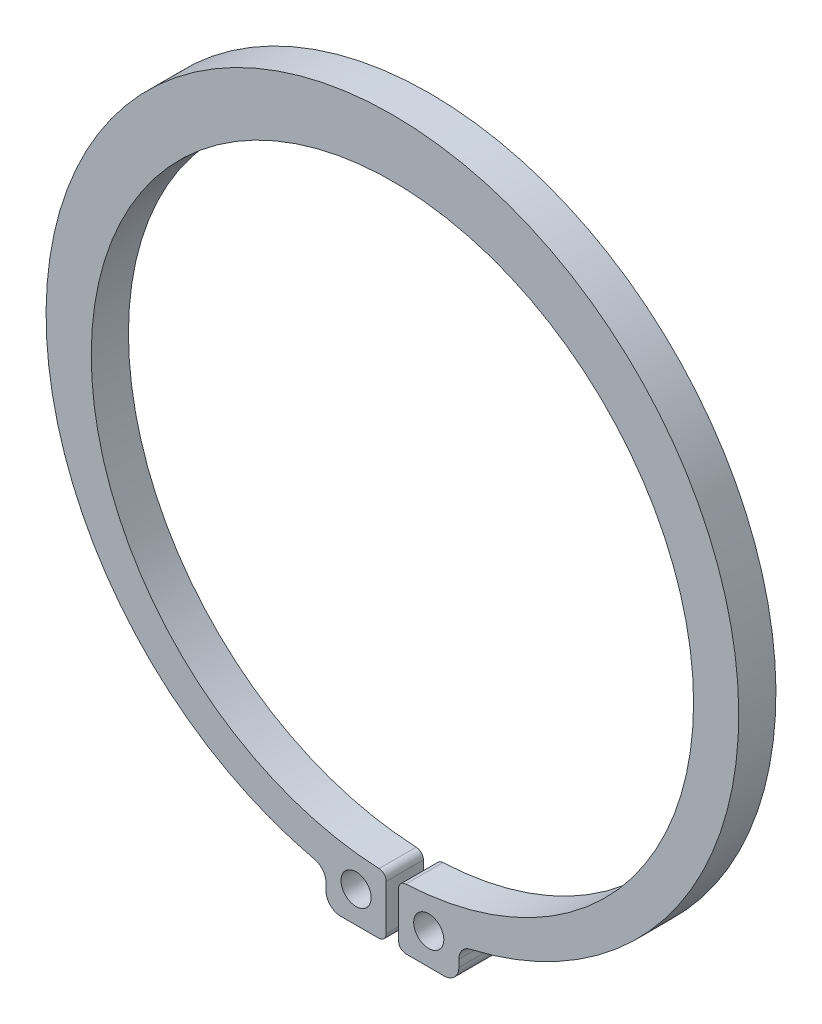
ISO-10303-21;
HEADER;
FILE_DESCRIPTION(('STEP AP214'),'2;1');
FILE_NAME('part.step','',(''),(''),'','','');
FILE_SCHEMA(('AUTOMOTIVE_DESIGN { 1 0 10303 214 1 1 1 1 }'));
ENDSEC;
DATA;
#1=APPLICATION_CONTEXT('core data for automotive mechanical design processes');
#2=APPLICATION_PROTOCOL_DEFINITION('international standard','automotive_design',2000,#1);
#3=PRODUCT_CONTEXT('',#1,'mechanical');
#4=PRODUCT('Part','Part','',(#3));
#5=PRODUCT_RELATED_PRODUCT_CATEGORY('part','',(#4));
#6=PRODUCT_DEFINITION_FORMATION('','',#4);
#7=PRODUCT_DEFINITION_CONTEXT('part definition',#1,'design');
#8=PRODUCT_DEFINITION('design','',#6,#7);
#9=PRODUCT_DEFINITION_SHAPE('','',#8);
#10=(LENGTH_UNIT() NAMED_UNIT(*) SI_UNIT(.MILLI.,.METRE.));
#11=(NAMED_UNIT(*) PLANE_ANGLE_UNIT() SI_UNIT($,.RADIAN.));
#12=(NAMED_UNIT(*) SI_UNIT($,.STERADIAN.) SOLID_ANGLE_UNIT());
#13=UNCERTAINTY_MEASURE_WITH_UNIT(LENGTH_MEASURE(1.E-05),#10,'distance_accuracy_value','');
#14=(GEOMETRIC_REPRESENTATION_CONTEXT(3) GLOBAL_UNCERTAINTY_ASSIGNED_CONTEXT((#13)) GLOBAL_UNIT_ASSIGNED_CONTEXT((#10,
#11,#12)) REPRESENTATION_CONTEXT('',''));
#15=CARTESIAN_POINT('',(0.,0.,0.));
#16=DIRECTION('',(0.,0.,1.));
#17=DIRECTION('',(1.,0.,0.));
#18=AXIS2_PLACEMENT_3D('',#15,#16,#17);
#19=CARTESIAN_POINT('',(0.,0.,1.));
#20=DIRECTION('',(0.,0.,1.));
#21=DIRECTION('',(1.,0.,0.));
#22=AXIS2_PLACEMENT_3D('',#19,#20,#21);
#23=PLANE('',#22);
#24=DIRECTION('',(-1.,0.,0.));
#25=VECTOR('',#24,1.);
#26=CARTESIAN_POINT('',(-0.166666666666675,-10.0516184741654,1.));
#27=LINE('',#26,#25);
#28=CARTESIAN_POINT('',(-0.369166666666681,-10.0516184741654,1.));
#29=VERTEX_POINT('',#28);
#30=CARTESIAN_POINT('',(-1.39154471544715,-10.0516184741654,1.));
#31=VERTEX_POINT('',#30);
#32=EDGE_CURVE('E158',#29,#31,#27,.T.);
#33=ORIENTED_EDGE('',*,*,#32,.F.);
#34=CARTESIAN_POINT('',(-0.369166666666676,-9.8491184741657,1.));
#35=DIRECTION('',(0.,0.,1.));
#36=DIRECTION('',(1.,0.,0.));
#37=AXIS2_PLACEMENT_3D('',#34,#35,#36);
#38=CIRCLE('',#37,0.2025);
#39=CARTESIAN_POINT('',(-0.166666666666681,-9.84911847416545,1.));
#40=VERTEX_POINT('',#39);
#41=EDGE_CURVE('E224',#29,#40,#38,.T.);
#42=ORIENTED_EDGE('',*,*,#41,.T.);
#43=DIRECTION('',(0.,-1.,0.));
#44=VECTOR('',#43,1.);
#45=CARTESIAN_POINT('',(-0.166666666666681,-8.43161847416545,1.));
#46=LINE('',#45,#44);
#47=CARTESIAN_POINT('',(-0.166666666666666,-8.62762186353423,1.));
#48=VERTEX_POINT('',#47);
#49=EDGE_CURVE('E172',#48,#40,#46,.T.);
#50=ORIENTED_EDGE('',*,*,#49,.F.);
#51=CARTESIAN_POINT('',(-0.369166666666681,-8.62762186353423,1.));
#52=DIRECTION('',(0.,0.,1.));
#53=DIRECTION('',(1.,0.,0.));
#54=AXIS2_PLACEMENT_3D('',#51,#52,#53);
#55=CIRCLE('',#54,0.2025);
#56=CARTESIAN_POINT('',(-0.36016260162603,-8.42532214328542,1.));
#57=VERTEX_POINT('',#56);
#58=EDGE_CURVE('E220',#48,#57,#55,.T.);
#59=ORIENTED_EDGE('',*,*,#58,.T.);
#60=CARTESIAN_POINT('',(0.,-0.333333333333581,1.));
#61=DIRECTION('',(0.,0.,1.));
#62=DIRECTION('',(1.,0.,0.));
#63=AXIS2_PLACEMENT_3D('',#60,#61,#62);
#64=CIRCLE('',#63,8.1);
#65=CARTESIAN_POINT('',(0.360162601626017,-8.42532214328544,1.));
#66=VERTEX_POINT('',#65);
#67=EDGE_CURVE('E175',#66,#57,#64,.T.);
#68=ORIENTED_EDGE('',*,*,#67,.F.);
#69=CARTESIAN_POINT('',(0.369166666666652,-8.62762186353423,1.));
#70=DIRECTION('',(0.,0.,1.));
#71=DIRECTION('',(1.,0.,0.));
#72=AXIS2_PLACEMENT_3D('',#69,#70,#71);
#73=CIRCLE('',#72,0.2025);
#74=CARTESIAN_POINT('',(0.166666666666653,-8.62762186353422,1.));
#75=VERTEX_POINT('',#74);
#76=EDGE_CURVE('E218',#66,#75,#73,.T.);
#77=ORIENTED_EDGE('',*,*,#76,.T.);
#78=DIRECTION('',(0.,-1.,0.));
#79=VECTOR('',#78,1.);
#80=CARTESIAN_POINT('',(0.166666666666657,-8.4316184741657,1.));
#81=LINE('',#80,#79);
#82=CARTESIAN_POINT('',(0.166666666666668,-9.84911847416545,1.));
#83=VERTEX_POINT('',#82);
#84=EDGE_CURVE('E176',#75,#83,#81,.T.);
#85=ORIENTED_EDGE('',*,*,#84,.T.);
#86=CARTESIAN_POINT('',(0.369166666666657,-9.8491184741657,1.));
#87=DIRECTION('',(0.,0.,1.));
#88=DIRECTION('',(1.,0.,0.));
#89=AXIS2_PLACEMENT_3D('',#86,#87,#88);
#90=CIRCLE('',#89,0.2025);
#91=CARTESIAN_POINT('',(0.369166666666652,-10.0516184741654,1.));
#92=VERTEX_POINT('',#91);
#93=EDGE_CURVE('E222',#83,#92,#90,.T.);
#94=ORIENTED_EDGE('',*,*,#93,.T.);
#95=DIRECTION('',(1.,0.,0.));
#96=VECTOR('',#95,1.);
#97=CARTESIAN_POINT('',(0.166666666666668,-10.0516184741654,1.));
#98=LINE('',#97,#96);
#99=CARTESIAN_POINT('',(1.39154471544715,-10.0516184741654,1.));
#100=VERTEX_POINT('',#99);
#101=EDGE_CURVE('E269',#92,#100,#98,.T.);
#102=ORIENTED_EDGE('',*,*,#101,.T.);
#103=CARTESIAN_POINT('',(1.39154471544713,-9.65649652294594,1.));
#104=DIRECTION('',(0.,0.,1.));
#105=DIRECTION('',(1.,0.,0.));
#106=AXIS2_PLACEMENT_3D('',#103,#104,#105);
#107=CIRCLE('',#106,0.395121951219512);
#108=CARTESIAN_POINT('',(1.78666666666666,-9.65649652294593,1.));
#109=VERTEX_POINT('',#108);
#110=EDGE_CURVE('E140',#100,#109,#107,.T.);
#111=ORIENTED_EDGE('',*,*,#110,.T.);
#112=DIRECTION('',(0.,1.,0.));
#113=VECTOR('',#112,1.);
#114=CARTESIAN_POINT('',(1.78666666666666,-10.0516184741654,1.));
#115=LINE('',#114,#113);
#116=CARTESIAN_POINT('',(1.78666666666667,-9.46183210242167,1.));
#117=VERTEX_POINT('',#116);
#118=EDGE_CURVE('E271',#109,#117,#115,.T.);
#119=ORIENTED_EDGE('',*,*,#118,.T.);
#120=CARTESIAN_POINT('',(2.18178861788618,-9.46183210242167,1.));
#121=DIRECTION('',(0.,0.,1.));
#122=DIRECTION('',(1.,0.,0.));
#123=AXIS2_PLACEMENT_3D('',#120,#121,#122);
#124=CIRCLE('',#123,0.395121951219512);
#125=CARTESIAN_POINT('',(2.09300779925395,-9.07681350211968,1.));
#126=VERTEX_POINT('',#125);
#127=EDGE_CURVE('E213',#117,#126,#124,.F.);
#128=ORIENTED_EDGE('',*,*,#127,.T.);
#129=CARTESIAN_POINT('',(0.,0.,1.));
#130=DIRECTION('',(0.,0.,1.));
#131=DIRECTION('',(1.,0.,0.));
#132=AXIS2_PLACEMENT_3D('',#129,#130,#131);
#133=CIRCLE('',#132,9.315);
#134=CARTESIAN_POINT('',(-2.09300779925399,-9.07681350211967,1.));
#135=VERTEX_POINT('',#134);
#136=EDGE_CURVE('E152',#126,#135,#133,.T.);
#137=ORIENTED_EDGE('',*,*,#136,.T.);
#138=CARTESIAN_POINT('',(-2.18178861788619,-9.46183210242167,1.));
#139=DIRECTION('',(0.,0.,1.));
#140=DIRECTION('',(1.,0.,0.));
#141=AXIS2_PLACEMENT_3D('',#138,#139,#140);
#142=CIRCLE('',#141,0.395121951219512);
#143=CARTESIAN_POINT('',(-1.78666666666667,-9.46183210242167,1.));
#144=VERTEX_POINT('',#143);
#145=EDGE_CURVE('E157',#135,#144,#142,.F.);
#146=ORIENTED_EDGE('',*,*,#145,.T.);
#147=DIRECTION('',(0.,1.,0.));
#148=VECTOR('',#147,1.);
#149=CARTESIAN_POINT('',(-1.78666666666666,-10.0516184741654,1.));
#150=LINE('',#149,#148);
#151=CARTESIAN_POINT('',(-1.78666666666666,-9.65649652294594,1.));
#152=VERTEX_POINT('',#151);
#153=EDGE_CURVE('E147',#152,#144,#150,.T.);
#154=ORIENTED_EDGE('',*,*,#153,.F.);
#155=CARTESIAN_POINT('',(-1.39154471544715,-9.65649652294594,1.));
#156=DIRECTION('',(0.,0.,1.));
#157=DIRECTION('',(1.,0.,0.));
#158=AXIS2_PLACEMENT_3D('',#155,#156,#157);
#159=CIRCLE('',#158,0.395121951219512);
#160=EDGE_CURVE('E130',#152,#31,#159,.T.);
#161=ORIENTED_EDGE('',*,*,#160,.T.);
#162=EDGE_LOOP('',(#33,#42,#50,#59,#68,#77,#85,#94,#102,#111,#119,#128,#137,#146,#154,#161));
#163=FACE_BOUND('',#162,.T.);
#164=CARTESIAN_POINT('',(-0.976666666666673,-9.21292744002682,1.));
#165=DIRECTION('',(0.,0.,1.));
#166=DIRECTION('',(1.,0.,0.));
#167=AXIS2_PLACEMENT_3D('',#164,#165,#166);
#168=CIRCLE('',#167,0.405);
#169=CARTESIAN_POINT('',(-0.571666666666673,-9.21292744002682,1.));
#170=VERTEX_POINT('',#169);
#171=EDGE_CURVE('E277',#170,#170,#168,.T.);
#172=ORIENTED_EDGE('',*,*,#171,.F.);
#173=EDGE_LOOP('',(#172));
#174=FACE_BOUND('',#173,.T.);
#175=CARTESIAN_POINT('',(0.976666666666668,-9.21292744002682,1.));
#176=DIRECTION('',(0.,0.,-1.));
#177=DIRECTION('',(-1.,0.,0.));
#178=AXIS2_PLACEMENT_3D('',#175,#176,#177);
#179=CIRCLE('',#178,0.405);
#180=CARTESIAN_POINT('',(0.571666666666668,-9.21292744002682,1.));
#181=VERTEX_POINT('',#180);
#182=EDGE_CURVE('E283',#181,#181,#179,.T.);
#183=ORIENTED_EDGE('',*,*,#182,.T.);
#184=EDGE_LOOP('',(#183));
#185=FACE_BOUND('',#184,.T.);
#186=ADVANCED_FACE('F16',(#163,#174,#185),#23,.T.);
#187=CARTESIAN_POINT('',(0.,0.,0.));
#188=DIRECTION('',(0.,0.,1.));
#189=DIRECTION('',(1.,0.,0.));
#190=AXIS2_PLACEMENT_3D('',#187,#188,#189);
#191=PLANE('',#190);
#192=DIRECTION('',(0.,-1.,0.));
#193=VECTOR('',#192,1.);
#194=CARTESIAN_POINT('',(-0.166666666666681,-8.43161847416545,0.));
#195=LINE('',#194,#193);
#196=CARTESIAN_POINT('',(-0.166666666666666,-8.62762186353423,0.));
#197=VERTEX_POINT('',#196);
#198=CARTESIAN_POINT('',(-0.166666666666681,-9.84911847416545,0.));
#199=VERTEX_POINT('',#198);
#200=EDGE_CURVE('E171',#197,#199,#195,.T.);
#201=ORIENTED_EDGE('',*,*,#200,.T.);
#202=CARTESIAN_POINT('',(-0.369166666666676,-9.8491184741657,0.));
#203=DIRECTION('',(0.,0.,1.));
#204=DIRECTION('',(1.,0.,0.));
#205=AXIS2_PLACEMENT_3D('',#202,#203,#204);
#206=CIRCLE('',#205,0.2025);
#207=CARTESIAN_POINT('',(-0.369166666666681,-10.0516184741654,0.));
#208=VERTEX_POINT('',#207);
#209=EDGE_CURVE('E236',#199,#208,#206,.F.);
#210=ORIENTED_EDGE('',*,*,#209,.T.);
#211=DIRECTION('',(-1.,0.,0.));
#212=VECTOR('',#211,1.);
#213=CARTESIAN_POINT('',(-0.166666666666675,-10.0516184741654,0.));
#214=LINE('',#213,#212);
#215=CARTESIAN_POINT('',(-1.39154471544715,-10.0516184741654,0.));
#216=VERTEX_POINT('',#215);
#217=EDGE_CURVE('E165',#208,#216,#214,.T.);
#218=ORIENTED_EDGE('',*,*,#217,.T.);
#219=CARTESIAN_POINT('',(-1.39154471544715,-9.65649652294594,0.));
#220=DIRECTION('',(0.,0.,1.));
#221=DIRECTION('',(1.,0.,0.));
#222=AXIS2_PLACEMENT_3D('',#219,#220,#221);
#223=CIRCLE('',#222,0.395121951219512);
#224=CARTESIAN_POINT('',(-1.78666666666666,-9.65649652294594,0.));
#225=VERTEX_POINT('',#224);
#226=EDGE_CURVE('E199',#216,#225,#223,.F.);
#227=ORIENTED_EDGE('',*,*,#226,.T.);
#228=DIRECTION('',(0.,1.,0.));
#229=VECTOR('',#228,1.);
#230=CARTESIAN_POINT('',(-1.78666666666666,-10.0516184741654,0.));
#231=LINE('',#230,#229);
#232=CARTESIAN_POINT('',(-1.78666666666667,-9.46183210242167,0.));
#233=VERTEX_POINT('',#232);
#234=EDGE_CURVE('E150',#225,#233,#231,.T.);
#235=ORIENTED_EDGE('',*,*,#234,.T.);
#236=CARTESIAN_POINT('',(-2.18178861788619,-9.46183210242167,0.));
#237=DIRECTION('',(0.,0.,1.));
#238=DIRECTION('',(1.,0.,0.));
#239=AXIS2_PLACEMENT_3D('',#236,#237,#238);
#240=CIRCLE('',#239,0.395121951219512);
#241=CARTESIAN_POINT('',(-2.09300779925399,-9.07681350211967,0.));
#242=VERTEX_POINT('',#241);
#243=EDGE_CURVE('E208',#233,#242,#240,.T.);
#244=ORIENTED_EDGE('',*,*,#243,.T.);
#245=CARTESIAN_POINT('',(0.,0.,0.));
#246=DIRECTION('',(0.,0.,1.));
#247=DIRECTION('',(1.,0.,0.));
#248=AXIS2_PLACEMENT_3D('',#245,#246,#247);
#249=CIRCLE('',#248,9.315);
#250=CARTESIAN_POINT('',(2.09300779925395,-9.07681350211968,0.));
#251=VERTEX_POINT('',#250);
#252=EDGE_CURVE('E183',#251,#242,#249,.T.);
#253=ORIENTED_EDGE('',*,*,#252,.F.);
#254=CARTESIAN_POINT('',(2.18178861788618,-9.46183210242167,0.));
#255=DIRECTION('',(0.,0.,1.));
#256=DIRECTION('',(1.,0.,0.));
#257=AXIS2_PLACEMENT_3D('',#254,#255,#256);
#258=CIRCLE('',#257,0.395121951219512);
#259=CARTESIAN_POINT('',(1.78666666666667,-9.46183210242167,0.));
#260=VERTEX_POINT('',#259);
#261=EDGE_CURVE('E211',#251,#260,#258,.T.);
#262=ORIENTED_EDGE('',*,*,#261,.T.);
#263=DIRECTION('',(0.,1.,0.));
#264=VECTOR('',#263,1.);
#265=CARTESIAN_POINT('',(1.78666666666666,-10.0516184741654,0.));
#266=LINE('',#265,#264);
#267=CARTESIAN_POINT('',(1.78666666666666,-9.65649652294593,0.));
#268=VERTEX_POINT('',#267);
#269=EDGE_CURVE('E162',#268,#260,#266,.T.);
#270=ORIENTED_EDGE('',*,*,#269,.F.);
#271=CARTESIAN_POINT('',(1.39154471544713,-9.65649652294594,0.));
#272=DIRECTION('',(0.,0.,1.));
#273=DIRECTION('',(1.,0.,0.));
#274=AXIS2_PLACEMENT_3D('',#271,#272,#273);
#275=CIRCLE('',#274,0.395121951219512);
#276=CARTESIAN_POINT('',(1.39154471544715,-10.0516184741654,0.));
#277=VERTEX_POINT('',#276);
#278=EDGE_CURVE('E196',#268,#277,#275,.F.);
#279=ORIENTED_EDGE('',*,*,#278,.T.);
#280=DIRECTION('',(1.,0.,0.));
#281=VECTOR('',#280,1.);
#282=CARTESIAN_POINT('',(0.166666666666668,-10.0516184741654,0.));
#283=LINE('',#282,#281);
#284=CARTESIAN_POINT('',(0.369166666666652,-10.0516184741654,0.));
#285=VERTEX_POINT('',#284);
#286=EDGE_CURVE('E159',#285,#277,#283,.T.);
#287=ORIENTED_EDGE('',*,*,#286,.F.);
#288=CARTESIAN_POINT('',(0.369166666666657,-9.8491184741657,0.));
#289=DIRECTION('',(0.,0.,1.));
#290=DIRECTION('',(1.,0.,0.));
#291=AXIS2_PLACEMENT_3D('',#288,#289,#290);
#292=CIRCLE('',#291,0.2025);
#293=CARTESIAN_POINT('',(0.166666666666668,-9.84911847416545,0.));
#294=VERTEX_POINT('',#293);
#295=EDGE_CURVE('E234',#285,#294,#292,.F.);
#296=ORIENTED_EDGE('',*,*,#295,.T.);
#297=DIRECTION('',(0.,-1.,0.));
#298=VECTOR('',#297,1.);
#299=CARTESIAN_POINT('',(0.166666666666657,-8.4316184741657,0.));
#300=LINE('',#299,#298);
#301=CARTESIAN_POINT('',(0.166666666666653,-8.62762186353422,0.));
#302=VERTEX_POINT('',#301);
#303=EDGE_CURVE('E168',#302,#294,#300,.T.);
#304=ORIENTED_EDGE('',*,*,#303,.F.);
#305=CARTESIAN_POINT('',(0.369166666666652,-8.62762186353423,0.));
#306=DIRECTION('',(0.,0.,1.));
#307=DIRECTION('',(1.,0.,0.));
#308=AXIS2_PLACEMENT_3D('',#305,#306,#307);
#309=CIRCLE('',#308,0.2025);
#310=CARTESIAN_POINT('',(0.360162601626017,-8.42532214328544,0.));
#311=VERTEX_POINT('',#310);
#312=EDGE_CURVE('E36',#302,#311,#309,.F.);
#313=ORIENTED_EDGE('',*,*,#312,.T.);
#314=CARTESIAN_POINT('',(0.,-0.333333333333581,0.));
#315=DIRECTION('',(0.,0.,1.));
#316=DIRECTION('',(1.,0.,0.));
#317=AXIS2_PLACEMENT_3D('',#314,#315,#316);
#318=CIRCLE('',#317,8.1);
#319=CARTESIAN_POINT('',(-0.36016260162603,-8.42532214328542,0.));
#320=VERTEX_POINT('',#319);
#321=EDGE_CURVE('E181',#311,#320,#318,.T.);
#322=ORIENTED_EDGE('',*,*,#321,.T.);
#323=CARTESIAN_POINT('',(-0.369166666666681,-8.62762186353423,0.));
#324=DIRECTION('',(0.,0.,1.));
#325=DIRECTION('',(1.,0.,0.));
#326=AXIS2_PLACEMENT_3D('',#323,#324,#325);
#327=CIRCLE('',#326,0.2025);
#328=EDGE_CURVE('E232',#320,#197,#327,.F.);
#329=ORIENTED_EDGE('',*,*,#328,.T.);
#330=EDGE_LOOP('',(#201,#210,#218,#227,#235,#244,#253,#262,#270,#279,#287,#296,#304,#313,#322,#329));
#331=FACE_BOUND('',#330,.T.);
#332=CARTESIAN_POINT('',(-0.976666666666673,-9.21292744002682,0.));
#333=DIRECTION('',(0.,0.,1.));
#334=DIRECTION('',(1.,0.,0.));
#335=AXIS2_PLACEMENT_3D('',#332,#333,#334);
#336=CIRCLE('',#335,0.405);
#337=CARTESIAN_POINT('',(-0.571666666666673,-9.21292744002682,0.));
#338=VERTEX_POINT('',#337);
#339=EDGE_CURVE('E273',#338,#338,#336,.T.);
#340=ORIENTED_EDGE('',*,*,#339,.T.);
#341=EDGE_LOOP('',(#340));
#342=FACE_BOUND('',#341,.T.);
#343=CARTESIAN_POINT('',(0.976666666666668,-9.21292744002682,0.));
#344=DIRECTION('',(0.,0.,-1.));
#345=DIRECTION('',(-1.,0.,0.));
#346=AXIS2_PLACEMENT_3D('',#343,#344,#345);
#347=CIRCLE('',#346,0.405);
#348=CARTESIAN_POINT('',(0.571666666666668,-9.21292744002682,0.));
#349=VERTEX_POINT('',#348);
#350=EDGE_CURVE('E280',#349,#349,#347,.T.);
#351=ORIENTED_EDGE('',*,*,#350,.F.);
#352=EDGE_LOOP('',(#351));
#353=FACE_BOUND('',#352,.T.);
#354=ADVANCED_FACE('F260',(#331,#342,#353),#191,.F.);
#355=CARTESIAN_POINT('',(0.,0.,1.));
#356=DIRECTION('',(0.,0.,-1.));
#357=DIRECTION('',(-1.,0.,0.));
#358=AXIS2_PLACEMENT_3D('',#355,#356,#357);
#359=CYLINDRICAL_SURFACE('',#358,9.315);
#360=ORIENTED_EDGE('',*,*,#252,.T.);
#361=DIRECTION('',(0.,0.,-1.));
#362=VECTOR('',#361,1.);
#363=CARTESIAN_POINT('',(-2.09300779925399,-9.07681350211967,1.));
#364=LINE('',#363,#362);
#365=EDGE_CURVE('E192',#242,#135,#364,.F.);
#366=ORIENTED_EDGE('',*,*,#365,.T.);
#367=ORIENTED_EDGE('',*,*,#136,.F.);
#368=DIRECTION('',(0.,0.,-1.));
#369=VECTOR('',#368,1.);
#370=CARTESIAN_POINT('',(2.09300779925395,-9.07681350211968,1.));
#371=LINE('',#370,#369);
#372=EDGE_CURVE('E189',#126,#251,#371,.T.);
#373=ORIENTED_EDGE('',*,*,#372,.T.);
#374=EDGE_LOOP('',(#360,#366,#367,#373));
#375=FACE_BOUND('',#374,.T.);
#376=ADVANCED_FACE('F293',(#375),#359,.T.);
#377=CARTESIAN_POINT('',(0.,-0.333333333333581,0.));
#378=DIRECTION('',(0.,0.,1.));
#379=DIRECTION('',(1.,0.,0.));
#380=AXIS2_PLACEMENT_3D('',#377,#378,#379);
#381=CYLINDRICAL_SURFACE('',#380,8.1);
#382=ORIENTED_EDGE('',*,*,#67,.T.);
#383=DIRECTION('',(0.,0.,1.));
#384=VECTOR('',#383,1.);
#385=CARTESIAN_POINT('',(-0.36016260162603,-8.42532214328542,0.));
#386=LINE('',#385,#384);
#387=EDGE_CURVE('E11',#57,#320,#386,.F.);
#388=ORIENTED_EDGE('',*,*,#387,.T.);
#389=ORIENTED_EDGE('',*,*,#321,.F.);
#390=DIRECTION('',(0.,0.,1.));
#391=VECTOR('',#390,1.);
#392=CARTESIAN_POINT('',(0.360162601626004,-8.42532214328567,0.));
#393=LINE('',#392,#391);
#394=EDGE_CURVE('E24',#311,#66,#393,.T.);
#395=ORIENTED_EDGE('',*,*,#394,.T.);
#396=EDGE_LOOP('',(#382,#388,#389,#395));
#397=FACE_BOUND('',#396,.T.);
#398=ADVANCED_FACE('F247',(#397),#381,.F.);
#399=CARTESIAN_POINT('',(-0.166666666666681,-8.43161847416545,0.));
#400=DIRECTION('',(-1.,0.,0.));
#401=DIRECTION('',(0.,-1.,0.));
#402=AXIS2_PLACEMENT_3D('',#399,#400,#401);
#403=PLANE('',#402);
#404=ORIENTED_EDGE('',*,*,#49,.T.);
#405=DIRECTION('',(0.,0.,1.));
#406=VECTOR('',#405,1.);
#407=CARTESIAN_POINT('',(-0.166666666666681,-9.84911847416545,0.));
#408=LINE('',#407,#406);
#409=EDGE_CURVE('E229',#40,#199,#408,.F.);
#410=ORIENTED_EDGE('',*,*,#409,.T.);
#411=ORIENTED_EDGE('',*,*,#200,.F.);
#412=DIRECTION('',(0.,0.,1.));
#413=VECTOR('',#412,1.);
#414=CARTESIAN_POINT('',(-0.166666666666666,-8.62762186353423,0.));
#415=LINE('',#414,#413);
#416=EDGE_CURVE('E226',#197,#48,#415,.T.);
#417=ORIENTED_EDGE('',*,*,#416,.T.);
#418=EDGE_LOOP('',(#404,#410,#411,#417));
#419=FACE_BOUND('',#418,.T.);
#420=ADVANCED_FACE('F257',(#419),#403,.F.);
#421=CARTESIAN_POINT('',(0.166666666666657,-8.4316184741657,0.));
#422=DIRECTION('',(-1.,0.,0.));
#423=DIRECTION('',(0.,-1.,0.));
#424=AXIS2_PLACEMENT_3D('',#421,#422,#423);
#425=PLANE('',#424);
#426=ORIENTED_EDGE('',*,*,#303,.T.);
#427=DIRECTION('',(0.,0.,1.));
#428=VECTOR('',#427,1.);
#429=CARTESIAN_POINT('',(0.166666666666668,-9.84911847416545,0.));
#430=LINE('',#429,#428);
#431=EDGE_CURVE('E240',#294,#83,#430,.T.);
#432=ORIENTED_EDGE('',*,*,#431,.T.);
#433=ORIENTED_EDGE('',*,*,#84,.F.);
#434=DIRECTION('',(0.,0.,-1.));
#435=VECTOR('',#434,1.);
#436=CARTESIAN_POINT('',(0.166666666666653,-8.62762186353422,0.));
#437=LINE('',#436,#435);
#438=EDGE_CURVE('E238',#75,#302,#437,.T.);
#439=ORIENTED_EDGE('',*,*,#438,.T.);
#440=EDGE_LOOP('',(#426,#432,#433,#439));
#441=FACE_BOUND('',#440,.T.);
#442=ADVANCED_FACE('F332',(#441),#425,.T.);
#443=CARTESIAN_POINT('',(-1.78666666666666,-10.0516184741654,0.));
#444=DIRECTION('',(1.,0.,0.));
#445=DIRECTION('',(0.,1.,0.));
#446=AXIS2_PLACEMENT_3D('',#443,#444,#445);
#447=PLANE('',#446);
#448=ORIENTED_EDGE('',*,*,#153,.T.);
#449=DIRECTION('',(0.,0.,1.));
#450=VECTOR('',#449,1.);
#451=CARTESIAN_POINT('',(-1.78666666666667,-9.46183210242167,0.));
#452=LINE('',#451,#450);
#453=EDGE_CURVE('E151',#144,#233,#452,.F.);
#454=ORIENTED_EDGE('',*,*,#453,.T.);
#455=ORIENTED_EDGE('',*,*,#234,.F.);
#456=DIRECTION('',(0.,0.,1.));
#457=VECTOR('',#456,1.);
#458=CARTESIAN_POINT('',(-1.78666666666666,-9.65649652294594,0.));
#459=LINE('',#458,#457);
#460=EDGE_CURVE('E134',#225,#152,#459,.T.);
#461=ORIENTED_EDGE('',*,*,#460,.T.);
#462=EDGE_LOOP('',(#448,#454,#455,#461));
#463=FACE_BOUND('',#462,.T.);
#464=ADVANCED_FACE('F145',(#463),#447,.F.);
#465=CARTESIAN_POINT('',(-0.166666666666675,-10.0516184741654,0.));
#466=DIRECTION('',(0.,1.,0.));
#467=DIRECTION('',(0.,0.,1.));
#468=AXIS2_PLACEMENT_3D('',#465,#466,#467);
#469=PLANE('',#468);
#470=ORIENTED_EDGE('',*,*,#217,.F.);
#471=DIRECTION('',(0.,0.,1.));
#472=VECTOR('',#471,1.);
#473=CARTESIAN_POINT('',(-0.369166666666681,-10.0516184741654,0.));
#474=LINE('',#473,#472);
#475=EDGE_CURVE('E215',#208,#29,#474,.T.);
#476=ORIENTED_EDGE('',*,*,#475,.T.);
#477=ORIENTED_EDGE('',*,*,#32,.T.);
#478=DIRECTION('',(0.,0.,1.));
#479=VECTOR('',#478,1.);
#480=CARTESIAN_POINT('',(-1.39154471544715,-10.0516184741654,0.));
#481=LINE('',#480,#479);
#482=EDGE_CURVE('E136',#31,#216,#481,.F.);
#483=ORIENTED_EDGE('',*,*,#482,.T.);
#484=EDGE_LOOP('',(#470,#476,#477,#483));
#485=FACE_BOUND('',#484,.T.);
#486=ADVANCED_FACE('F267',(#485),#469,.F.);
#487=CARTESIAN_POINT('',(1.78666666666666,-10.0516184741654,0.));
#488=DIRECTION('',(1.,0.,0.));
#489=DIRECTION('',(0.,1.,0.));
#490=AXIS2_PLACEMENT_3D('',#487,#488,#489);
#491=PLANE('',#490);
#492=ORIENTED_EDGE('',*,*,#118,.F.);
#493=DIRECTION('',(0.,0.,1.));
#494=VECTOR('',#493,1.);
#495=CARTESIAN_POINT('',(1.78666666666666,-9.65649652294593,0.));
#496=LINE('',#495,#494);
#497=EDGE_CURVE('E206',#109,#268,#496,.F.);
#498=ORIENTED_EDGE('',*,*,#497,.T.);
#499=ORIENTED_EDGE('',*,*,#269,.T.);
#500=DIRECTION('',(0.,0.,-1.));
#501=VECTOR('',#500,1.);
#502=CARTESIAN_POINT('',(1.78666666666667,-9.46183210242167,0.));
#503=LINE('',#502,#501);
#504=EDGE_CURVE('E204',#260,#117,#503,.F.);
#505=ORIENTED_EDGE('',*,*,#504,.T.);
#506=EDGE_LOOP('',(#492,#498,#499,#505));
#507=FACE_BOUND('',#506,.T.);
#508=ADVANCED_FACE('F347',(#507),#491,.T.);
#509=CARTESIAN_POINT('',(0.166666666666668,-10.0516184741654,0.));
#510=DIRECTION('',(0.,-1.,0.));
#511=DIRECTION('',(0.,0.,-1.));
#512=AXIS2_PLACEMENT_3D('',#509,#510,#511);
#513=PLANE('',#512);
#514=ORIENTED_EDGE('',*,*,#101,.F.);
#515=DIRECTION('',(0.,0.,1.));
#516=VECTOR('',#515,1.);
#517=CARTESIAN_POINT('',(0.369166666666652,-10.0516184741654,0.));
#518=LINE('',#517,#516);
#519=EDGE_CURVE('E243',#92,#285,#518,.F.);
#520=ORIENTED_EDGE('',*,*,#519,.T.);
#521=ORIENTED_EDGE('',*,*,#286,.T.);
#522=DIRECTION('',(0.,0.,1.));
#523=VECTOR('',#522,1.);
#524=CARTESIAN_POINT('',(1.39154471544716,-10.0516184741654,0.));
#525=LINE('',#524,#523);
#526=EDGE_CURVE('E201',#277,#100,#525,.T.);
#527=ORIENTED_EDGE('',*,*,#526,.T.);
#528=EDGE_LOOP('',(#514,#520,#521,#527));
#529=FACE_BOUND('',#528,.T.);
#530=ADVANCED_FACE('F340',(#529),#513,.T.);
#531=CARTESIAN_POINT('',(-0.976666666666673,-9.21292744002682,0.));
#532=DIRECTION('',(0.,0.,1.));
#533=DIRECTION('',(1.,0.,0.));
#534=AXIS2_PLACEMENT_3D('',#531,#532,#533);
#535=CYLINDRICAL_SURFACE('',#534,0.405);
#536=ORIENTED_EDGE('',*,*,#339,.F.);
#537=EDGE_LOOP('',(#536));
#538=FACE_BOUND('',#537,.T.);
#539=ORIENTED_EDGE('',*,*,#171,.T.);
#540=EDGE_LOOP('',(#539));
#541=FACE_BOUND('',#540,.T.);
#542=ADVANCED_FACE('F360',(#538,#541),#535,.F.);
#543=CARTESIAN_POINT('',(0.976666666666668,-9.21292744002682,0.));
#544=DIRECTION('',(0.,0.,1.));
#545=DIRECTION('',(1.,0.,0.));
#546=AXIS2_PLACEMENT_3D('',#543,#544,#545);
#547=CYLINDRICAL_SURFACE('',#546,0.405);
#548=ORIENTED_EDGE('',*,*,#350,.T.);
#549=EDGE_LOOP('',(#548));
#550=FACE_BOUND('',#549,.T.);
#551=ORIENTED_EDGE('',*,*,#182,.F.);
#552=EDGE_LOOP('',(#551));
#553=FACE_BOUND('',#552,.T.);
#554=ADVANCED_FACE('F289',(#550,#553),#547,.F.);
#555=CARTESIAN_POINT('',(-2.18178861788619,-9.46183210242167,1.));
#556=DIRECTION('',(0.,0.,-1.));
#557=DIRECTION('',(-1.,0.,0.));
#558=AXIS2_PLACEMENT_3D('',#555,#556,#557);
#559=CYLINDRICAL_SURFACE('',#558,0.395121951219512);
#560=ORIENTED_EDGE('',*,*,#145,.F.);
#561=ORIENTED_EDGE('',*,*,#365,.F.);
#562=ORIENTED_EDGE('',*,*,#243,.F.);
#563=ORIENTED_EDGE('',*,*,#453,.F.);
#564=EDGE_LOOP('',(#560,#561,#562,#563));
#565=FACE_BOUND('',#564,.T.);
#566=ADVANCED_FACE('F305',(#565),#559,.F.);
#567=CARTESIAN_POINT('',(-1.39154471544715,-9.65649652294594,0.));
#568=DIRECTION('',(0.,0.,1.));
#569=DIRECTION('',(1.,0.,0.));
#570=AXIS2_PLACEMENT_3D('',#567,#568,#569);
#571=CYLINDRICAL_SURFACE('',#570,0.395121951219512);
#572=ORIENTED_EDGE('',*,*,#226,.F.);
#573=ORIENTED_EDGE('',*,*,#482,.F.);
#574=ORIENTED_EDGE('',*,*,#160,.F.);
#575=ORIENTED_EDGE('',*,*,#460,.F.);
#576=EDGE_LOOP('',(#572,#573,#574,#575));
#577=FACE_BOUND('',#576,.T.);
#578=ADVANCED_FACE('F133',(#577),#571,.T.);
#579=CARTESIAN_POINT('',(1.39154471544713,-9.65649652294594,0.));
#580=DIRECTION('',(0.,0.,1.));
#581=DIRECTION('',(1.,0.,0.));
#582=AXIS2_PLACEMENT_3D('',#579,#580,#581);
#583=CYLINDRICAL_SURFACE('',#582,0.395121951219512);
#584=ORIENTED_EDGE('',*,*,#278,.F.);
#585=ORIENTED_EDGE('',*,*,#497,.F.);
#586=ORIENTED_EDGE('',*,*,#110,.F.);
#587=ORIENTED_EDGE('',*,*,#526,.F.);
#588=EDGE_LOOP('',(#584,#585,#586,#587));
#589=FACE_BOUND('',#588,.T.);
#590=ADVANCED_FACE('F311',(#589),#583,.T.);
#591=CARTESIAN_POINT('',(2.18178861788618,-9.46183210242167,1.));
#592=DIRECTION('',(0.,0.,-1.));
#593=DIRECTION('',(-1.,0.,0.));
#594=AXIS2_PLACEMENT_3D('',#591,#592,#593);
#595=CYLINDRICAL_SURFACE('',#594,0.395121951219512);
#596=ORIENTED_EDGE('',*,*,#127,.F.);
#597=ORIENTED_EDGE('',*,*,#504,.F.);
#598=ORIENTED_EDGE('',*,*,#261,.F.);
#599=ORIENTED_EDGE('',*,*,#372,.F.);
#600=EDGE_LOOP('',(#596,#597,#598,#599));
#601=FACE_BOUND('',#600,.T.);
#602=ADVANCED_FACE('F314',(#601),#595,.F.);
#603=CARTESIAN_POINT('',(-0.369166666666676,-9.8491184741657,0.));
#604=DIRECTION('',(0.,0.,1.));
#605=DIRECTION('',(1.,0.,0.));
#606=AXIS2_PLACEMENT_3D('',#603,#604,#605);
#607=CYLINDRICAL_SURFACE('',#606,0.2025);
#608=ORIENTED_EDGE('',*,*,#209,.F.);
#609=ORIENTED_EDGE('',*,*,#409,.F.);
#610=ORIENTED_EDGE('',*,*,#41,.F.);
#611=ORIENTED_EDGE('',*,*,#475,.F.);
#612=EDGE_LOOP('',(#608,#609,#610,#611));
#613=FACE_BOUND('',#612,.T.);
#614=ADVANCED_FACE('F265',(#613),#607,.T.);
#615=CARTESIAN_POINT('',(0.369166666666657,-9.8491184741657,0.));
#616=DIRECTION('',(0.,0.,1.));
#617=DIRECTION('',(1.,0.,0.));
#618=AXIS2_PLACEMENT_3D('',#615,#616,#617);
#619=CYLINDRICAL_SURFACE('',#618,0.2025);
#620=ORIENTED_EDGE('',*,*,#295,.F.);
#621=ORIENTED_EDGE('',*,*,#519,.F.);
#622=ORIENTED_EDGE('',*,*,#93,.F.);
#623=ORIENTED_EDGE('',*,*,#431,.F.);
#624=EDGE_LOOP('',(#620,#621,#622,#623));
#625=FACE_BOUND('',#624,.T.);
#626=ADVANCED_FACE('F321',(#625),#619,.T.);
#627=CARTESIAN_POINT('',(-0.369166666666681,-8.62762186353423,0.));
#628=DIRECTION('',(0.,0.,1.));
#629=DIRECTION('',(1.,0.,0.));
#630=AXIS2_PLACEMENT_3D('',#627,#628,#629);
#631=CYLINDRICAL_SURFACE('',#630,0.2025);
#632=ORIENTED_EDGE('',*,*,#328,.F.);
#633=ORIENTED_EDGE('',*,*,#387,.F.);
#634=ORIENTED_EDGE('',*,*,#58,.F.);
#635=ORIENTED_EDGE('',*,*,#416,.F.);
#636=EDGE_LOOP('',(#632,#633,#634,#635));
#637=FACE_BOUND('',#636,.T.);
#638=ADVANCED_FACE('F254',(#637),#631,.T.);
#639=CARTESIAN_POINT('',(0.369166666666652,-8.62762186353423,0.));
#640=DIRECTION('',(0.,0.,1.));
#641=DIRECTION('',(1.,0.,0.));
#642=AXIS2_PLACEMENT_3D('',#639,#640,#641);
#643=CYLINDRICAL_SURFACE('',#642,0.2025);
#644=ORIENTED_EDGE('',*,*,#312,.F.);
#645=ORIENTED_EDGE('',*,*,#438,.F.);
#646=ORIENTED_EDGE('',*,*,#76,.F.);
#647=ORIENTED_EDGE('',*,*,#394,.F.);
#648=EDGE_LOOP('',(#644,#645,#646,#647));
#649=FACE_BOUND('',#648,.T.);
#650=ADVANCED_FACE('F18',(#649),#643,.T.);
#651=CLOSED_SHELL('',(#186,#354,#376,#398,#420,#442,#464,#486,#508,#530,#542,#554,#566,#578,
#590,#602,#614,#626,#638,#650));
#652=MANIFOLD_SOLID_BREP('B1',#651);
#653=ADVANCED_BREP_SHAPE_REPRESENTATION('',(#18,#652),#14);
#654=SHAPE_DEFINITION_REPRESENTATION(#9,#653);
ENDSEC;
END-ISO-10303-21;
